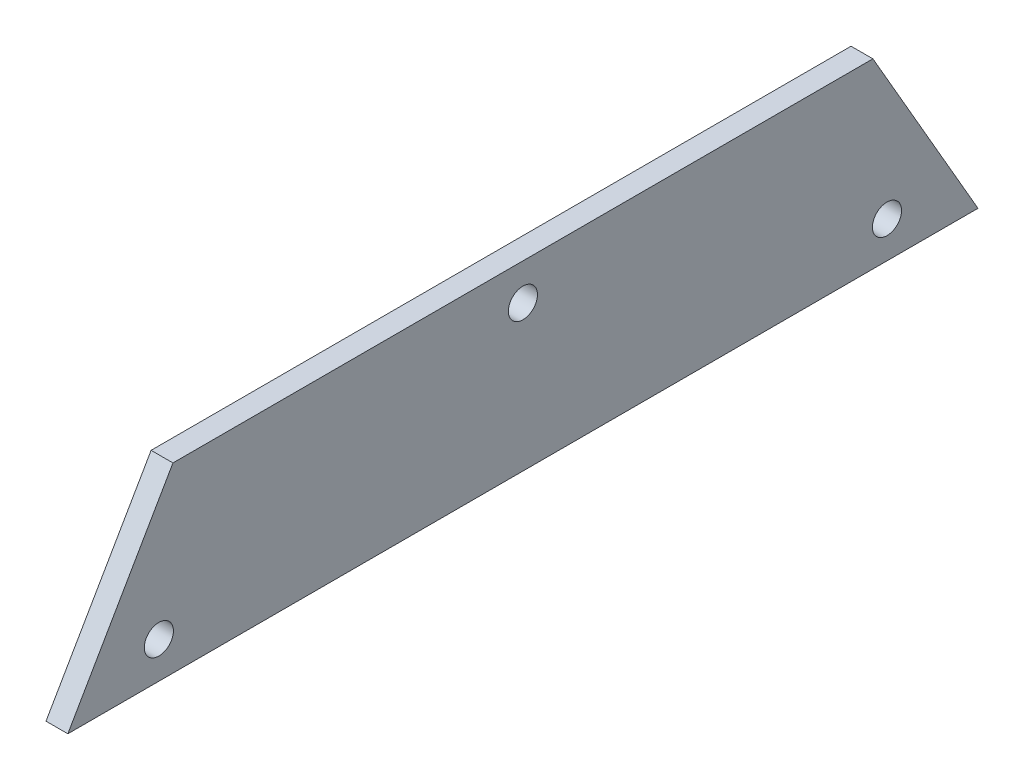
ISO-10303-21;
HEADER;
FILE_DESCRIPTION(('STEP AP214'),'2;1');
FILE_NAME('part.step','',(''),(''),'','','');
FILE_SCHEMA(('AUTOMOTIVE_DESIGN { 1 0 10303 214 1 1 1 1 }'));
ENDSEC;
DATA;
#1=APPLICATION_CONTEXT('core data for automotive mechanical design processes');
#2=APPLICATION_PROTOCOL_DEFINITION('international standard','automotive_design',2000,#1);
#3=PRODUCT_CONTEXT('',#1,'mechanical');
#4=PRODUCT('Part','Part','',(#3));
#5=PRODUCT_RELATED_PRODUCT_CATEGORY('part','',(#4));
#6=PRODUCT_DEFINITION_FORMATION('','',#4);
#7=PRODUCT_DEFINITION_CONTEXT('part definition',#1,'design');
#8=PRODUCT_DEFINITION('design','',#6,#7);
#9=PRODUCT_DEFINITION_SHAPE('','',#8);
#10=(LENGTH_UNIT() NAMED_UNIT(*) SI_UNIT(.MILLI.,.METRE.));
#11=(NAMED_UNIT(*) PLANE_ANGLE_UNIT() SI_UNIT($,.RADIAN.));
#12=(NAMED_UNIT(*) SI_UNIT($,.STERADIAN.) SOLID_ANGLE_UNIT());
#13=UNCERTAINTY_MEASURE_WITH_UNIT(LENGTH_MEASURE(1.E-05),#10,'distance_accuracy_value','');
#14=(GEOMETRIC_REPRESENTATION_CONTEXT(3) GLOBAL_UNCERTAINTY_ASSIGNED_CONTEXT((#13)) GLOBAL_UNIT_ASSIGNED_CONTEXT((#10,
#11,#12)) REPRESENTATION_CONTEXT('',''));
#15=CARTESIAN_POINT('',(0.,0.,0.));
#16=DIRECTION('',(0.,0.,1.));
#17=DIRECTION('',(1.,0.,0.));
#18=AXIS2_PLACEMENT_3D('',#15,#16,#17);
#19=CARTESIAN_POINT('',(6.,-25.,150.));
#20=DIRECTION('',(1.,0.,0.));
#21=DIRECTION('',(0.,0.,-1.));
#22=AXIS2_PLACEMENT_3D('',#19,#20,#21);
#23=PLANE('',#22);
#24=DIRECTION('',(0.,-0.86602540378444,-0.499999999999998));
#25=VECTOR('',#24,1.);
#26=CARTESIAN_POINT('',(6.,25.,-96.1324865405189));
#27=LINE('',#26,#25);
#28=CARTESIAN_POINT('',(6.,25.,-96.1324865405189));
#29=VERTEX_POINT('',#28);
#30=CARTESIAN_POINT('',(6.,-25.,-125.));
#31=VERTEX_POINT('',#30);
#32=EDGE_CURVE('E68',#29,#31,#27,.T.);
#33=ORIENTED_EDGE('',*,*,#32,.F.);
#34=DIRECTION('',(0.,0.,1.));
#35=VECTOR('',#34,1.);
#36=CARTESIAN_POINT('',(6.,25.,150.));
#37=LINE('',#36,#35);
#38=CARTESIAN_POINT('',(6.,25.,96.1324865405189));
#39=VERTEX_POINT('',#38);
#40=EDGE_CURVE('E11',#29,#39,#37,.T.);
#41=ORIENTED_EDGE('',*,*,#40,.T.);
#42=DIRECTION('',(0.,0.86602540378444,-0.499999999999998));
#43=VECTOR('',#42,1.);
#44=CARTESIAN_POINT('',(6.,25.,96.1324865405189));
#45=LINE('',#44,#43);
#46=CARTESIAN_POINT('',(6.,-25.,125.));
#47=VERTEX_POINT('',#46);
#48=EDGE_CURVE('E94',#47,#39,#45,.T.);
#49=ORIENTED_EDGE('',*,*,#48,.F.);
#50=DIRECTION('',(0.,0.,-1.));
#51=VECTOR('',#50,1.);
#52=CARTESIAN_POINT('',(6.,-25.,150.));
#53=LINE('',#52,#51);
#54=EDGE_CURVE('E35',#47,#31,#53,.T.);
#55=ORIENTED_EDGE('',*,*,#54,.T.);
#56=EDGE_LOOP('',(#33,#41,#49,#55));
#57=FACE_BOUND('',#56,.T.);
#58=CARTESIAN_POINT('',(6.,-15.,100.));
#59=DIRECTION('',(1.,0.,0.));
#60=DIRECTION('',(0.,0.,-1.));
#61=AXIS2_PLACEMENT_3D('',#58,#59,#60);
#62=CIRCLE('',#61,4.00000000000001);
#63=CARTESIAN_POINT('',(6.,-15.,96.));
#64=VERTEX_POINT('',#63);
#65=EDGE_CURVE('E115',#64,#64,#62,.T.);
#66=ORIENTED_EDGE('',*,*,#65,.F.);
#67=EDGE_LOOP('',(#66));
#68=FACE_BOUND('',#67,.T.);
#69=CARTESIAN_POINT('',(6.,15.,0.));
#70=DIRECTION('',(1.,0.,0.));
#71=DIRECTION('',(0.,0.,-1.));
#72=AXIS2_PLACEMENT_3D('',#69,#70,#71);
#73=CIRCLE('',#72,4.);
#74=CARTESIAN_POINT('',(6.,15.,-4.));
#75=VERTEX_POINT('',#74);
#76=EDGE_CURVE('E86',#75,#75,#73,.T.);
#77=ORIENTED_EDGE('',*,*,#76,.F.);
#78=EDGE_LOOP('',(#77));
#79=FACE_BOUND('',#78,.T.);
#80=CARTESIAN_POINT('',(6.,-14.9999999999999,-100.));
#81=DIRECTION('',(1.,0.,0.));
#82=DIRECTION('',(0.,0.,1.));
#83=AXIS2_PLACEMENT_3D('',#80,#81,#82);
#84=CIRCLE('',#83,3.99999999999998);
#85=CARTESIAN_POINT('',(6.,-14.9999999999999,-96.));
#86=VERTEX_POINT('',#85);
#87=EDGE_CURVE('E109',#86,#86,#84,.T.);
#88=ORIENTED_EDGE('',*,*,#87,.F.);
#89=EDGE_LOOP('',(#88));
#90=FACE_BOUND('',#89,.T.);
#91=ADVANCED_FACE('F27',(#57,#68,#79,#90),#23,.T.);
#92=CARTESIAN_POINT('',(0.,-25.,150.));
#93=DIRECTION('',(1.,0.,0.));
#94=DIRECTION('',(0.,0.,-1.));
#95=AXIS2_PLACEMENT_3D('',#92,#93,#94);
#96=PLANE('',#95);
#97=CARTESIAN_POINT('',(0.,-15.,100.));
#98=DIRECTION('',(1.,0.,0.));
#99=DIRECTION('',(0.,0.,-1.));
#100=AXIS2_PLACEMENT_3D('',#97,#98,#99);
#101=CIRCLE('',#100,4.00000000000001);
#102=CARTESIAN_POINT('',(0.,-15.,96.));
#103=VERTEX_POINT('',#102);
#104=EDGE_CURVE('E112',#103,#103,#101,.T.);
#105=ORIENTED_EDGE('',*,*,#104,.T.);
#106=EDGE_LOOP('',(#105));
#107=FACE_BOUND('',#106,.T.);
#108=DIRECTION('',(0.,0.,1.));
#109=VECTOR('',#108,1.);
#110=CARTESIAN_POINT('',(0.,25.,150.));
#111=LINE('',#110,#109);
#112=CARTESIAN_POINT('',(0.,25.,-96.1324865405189));
#113=VERTEX_POINT('',#112);
#114=CARTESIAN_POINT('',(0.,25.,96.1324865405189));
#115=VERTEX_POINT('',#114);
#116=EDGE_CURVE('E82',#113,#115,#111,.T.);
#117=ORIENTED_EDGE('',*,*,#116,.F.);
#118=DIRECTION('',(0.,0.86602540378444,0.499999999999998));
#119=VECTOR('',#118,1.);
#120=CARTESIAN_POINT('',(0.,25.,-96.1324865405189));
#121=LINE('',#120,#119);
#122=CARTESIAN_POINT('',(0.,-25.,-125.));
#123=VERTEX_POINT('',#122);
#124=EDGE_CURVE('E42',#123,#113,#121,.T.);
#125=ORIENTED_EDGE('',*,*,#124,.F.);
#126=DIRECTION('',(0.,0.,-1.));
#127=VECTOR('',#126,1.);
#128=CARTESIAN_POINT('',(0.,-25.,150.));
#129=LINE('',#128,#127);
#130=CARTESIAN_POINT('',(0.,-25.,125.));
#131=VERTEX_POINT('',#130);
#132=EDGE_CURVE('E81',#131,#123,#129,.T.);
#133=ORIENTED_EDGE('',*,*,#132,.F.);
#134=DIRECTION('',(0.,-0.86602540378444,0.499999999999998));
#135=VECTOR('',#134,1.);
#136=CARTESIAN_POINT('',(0.,25.,96.1324865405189));
#137=LINE('',#136,#135);
#138=EDGE_CURVE('E103',#115,#131,#137,.T.);
#139=ORIENTED_EDGE('',*,*,#138,.F.);
#140=EDGE_LOOP('',(#117,#125,#133,#139));
#141=FACE_BOUND('',#140,.T.);
#142=CARTESIAN_POINT('',(0.,15.,0.));
#143=DIRECTION('',(1.,0.,0.));
#144=DIRECTION('',(0.,0.,-1.));
#145=AXIS2_PLACEMENT_3D('',#142,#143,#144);
#146=CIRCLE('',#145,4.);
#147=CARTESIAN_POINT('',(0.,15.,-4.));
#148=VERTEX_POINT('',#147);
#149=EDGE_CURVE('E90',#148,#148,#146,.T.);
#150=ORIENTED_EDGE('',*,*,#149,.T.);
#151=EDGE_LOOP('',(#150));
#152=FACE_BOUND('',#151,.T.);
#153=CARTESIAN_POINT('',(0.,-14.9999999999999,-100.));
#154=DIRECTION('',(1.,0.,0.));
#155=DIRECTION('',(0.,0.,1.));
#156=AXIS2_PLACEMENT_3D('',#153,#154,#155);
#157=CIRCLE('',#156,3.99999999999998);
#158=CARTESIAN_POINT('',(0.,-14.9999999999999,-96.));
#159=VERTEX_POINT('',#158);
#160=EDGE_CURVE('E106',#159,#159,#157,.T.);
#161=ORIENTED_EDGE('',*,*,#160,.T.);
#162=EDGE_LOOP('',(#161));
#163=FACE_BOUND('',#162,.T.);
#164=ADVANCED_FACE('F78',(#107,#141,#152,#163),#96,.F.);
#165=CARTESIAN_POINT('',(6.,-25.,150.));
#166=DIRECTION('',(0.,1.,0.));
#167=DIRECTION('',(0.,0.,1.));
#168=AXIS2_PLACEMENT_3D('',#165,#166,#167);
#169=PLANE('',#168);
#170=ORIENTED_EDGE('',*,*,#132,.T.);
#171=DIRECTION('',(1.,0.,0.));
#172=VECTOR('',#171,1.);
#173=CARTESIAN_POINT('',(-0.00100000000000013,-25.,-125.));
#174=LINE('',#173,#172);
#175=EDGE_CURVE('E66',#123,#31,#174,.T.);
#176=ORIENTED_EDGE('',*,*,#175,.T.);
#177=ORIENTED_EDGE('',*,*,#54,.F.);
#178=DIRECTION('',(1.,0.,0.));
#179=VECTOR('',#178,1.);
#180=CARTESIAN_POINT('',(-0.00100000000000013,-25.,125.));
#181=LINE('',#180,#179);
#182=EDGE_CURVE('E85',#131,#47,#181,.T.);
#183=ORIENTED_EDGE('',*,*,#182,.F.);
#184=EDGE_LOOP('',(#170,#176,#177,#183));
#185=FACE_BOUND('',#184,.T.);
#186=ADVANCED_FACE('F29',(#185),#169,.F.);
#187=CARTESIAN_POINT('',(6.,25.,150.));
#188=DIRECTION('',(0.,-1.,0.));
#189=DIRECTION('',(0.,0.,-1.));
#190=AXIS2_PLACEMENT_3D('',#187,#188,#189);
#191=PLANE('',#190);
#192=ORIENTED_EDGE('',*,*,#40,.F.);
#193=DIRECTION('',(1.,0.,0.));
#194=VECTOR('',#193,1.);
#195=CARTESIAN_POINT('',(-0.00100000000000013,25.,-96.1324865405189));
#196=LINE('',#195,#194);
#197=EDGE_CURVE('E73',#113,#29,#196,.T.);
#198=ORIENTED_EDGE('',*,*,#197,.F.);
#199=ORIENTED_EDGE('',*,*,#116,.T.);
#200=DIRECTION('',(1.,0.,0.));
#201=VECTOR('',#200,1.);
#202=CARTESIAN_POINT('',(-0.00100000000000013,25.,96.1324865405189));
#203=LINE('',#202,#201);
#204=EDGE_CURVE('E99',#115,#39,#203,.T.);
#205=ORIENTED_EDGE('',*,*,#204,.T.);
#206=EDGE_LOOP('',(#192,#198,#199,#205));
#207=FACE_BOUND('',#206,.T.);
#208=ADVANCED_FACE('F124',(#207),#191,.F.);
#209=CARTESIAN_POINT('',(6.,15.,0.));
#210=DIRECTION('',(-1.,0.,0.));
#211=DIRECTION('',(0.,0.,1.));
#212=AXIS2_PLACEMENT_3D('',#209,#210,#211);
#213=CYLINDRICAL_SURFACE('',#212,4.);
#214=ORIENTED_EDGE('',*,*,#76,.T.);
#215=EDGE_LOOP('',(#214));
#216=FACE_BOUND('',#215,.T.);
#217=ORIENTED_EDGE('',*,*,#149,.F.);
#218=EDGE_LOOP('',(#217));
#219=FACE_BOUND('',#218,.T.);
#220=ADVANCED_FACE('F121',(#216,#219),#213,.F.);
#221=CARTESIAN_POINT('',(6.,-15.,100.));
#222=DIRECTION('',(-1.,0.,0.));
#223=DIRECTION('',(0.,0.,1.));
#224=AXIS2_PLACEMENT_3D('',#221,#222,#223);
#225=CYLINDRICAL_SURFACE('',#224,4.00000000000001);
#226=ORIENTED_EDGE('',*,*,#65,.T.);
#227=EDGE_LOOP('',(#226));
#228=FACE_BOUND('',#227,.T.);
#229=ORIENTED_EDGE('',*,*,#104,.F.);
#230=EDGE_LOOP('',(#229));
#231=FACE_BOUND('',#230,.T.);
#232=ADVANCED_FACE('F123',(#228,#231),#225,.F.);
#233=CARTESIAN_POINT('',(6.,-14.9999999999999,-100.));
#234=DIRECTION('',(-1.,0.,0.));
#235=DIRECTION('',(0.,0.,1.));
#236=AXIS2_PLACEMENT_3D('',#233,#234,#235);
#237=CYLINDRICAL_SURFACE('',#236,3.99999999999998);
#238=ORIENTED_EDGE('',*,*,#87,.T.);
#239=EDGE_LOOP('',(#238));
#240=FACE_BOUND('',#239,.T.);
#241=ORIENTED_EDGE('',*,*,#160,.F.);
#242=EDGE_LOOP('',(#241));
#243=FACE_BOUND('',#242,.T.);
#244=ADVANCED_FACE('F130',(#240,#243),#237,.F.);
#245=CARTESIAN_POINT('',(-0.00100000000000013,25.,96.1324865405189));
#246=DIRECTION('',(0.,-0.499999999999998,-0.86602540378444));
#247=DIRECTION('',(0.,0.86602540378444,-0.499999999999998));
#248=AXIS2_PLACEMENT_3D('',#245,#246,#247);
#249=PLANE('',#248);
#250=ORIENTED_EDGE('',*,*,#138,.T.);
#251=ORIENTED_EDGE('',*,*,#182,.T.);
#252=ORIENTED_EDGE('',*,*,#48,.T.);
#253=ORIENTED_EDGE('',*,*,#204,.F.);
#254=EDGE_LOOP('',(#250,#251,#252,#253));
#255=FACE_BOUND('',#254,.T.);
#256=ADVANCED_FACE('F157',(#255),#249,.F.);
#257=CARTESIAN_POINT('',(-0.00100000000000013,25.,-96.1324865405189));
#258=DIRECTION('',(0.,-0.499999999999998,0.86602540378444));
#259=DIRECTION('',(0.,-0.86602540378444,-0.499999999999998));
#260=AXIS2_PLACEMENT_3D('',#257,#258,#259);
#261=PLANE('',#260);
#262=ORIENTED_EDGE('',*,*,#124,.T.);
#263=ORIENTED_EDGE('',*,*,#197,.T.);
#264=ORIENTED_EDGE('',*,*,#32,.T.);
#265=ORIENTED_EDGE('',*,*,#175,.F.);
#266=EDGE_LOOP('',(#262,#263,#264,#265));
#267=FACE_BOUND('',#266,.T.);
#268=ADVANCED_FACE('F67',(#267),#261,.F.);
#269=CLOSED_SHELL('',(#91,#164,#186,#208,#220,#232,#244,#256,#268));
#270=MANIFOLD_SOLID_BREP('B2',#269);
#271=ADVANCED_BREP_SHAPE_REPRESENTATION('',(#18,#270),#14);
#272=SHAPE_DEFINITION_REPRESENTATION(#9,#271);
ENDSEC;
END-ISO-10303-21;
